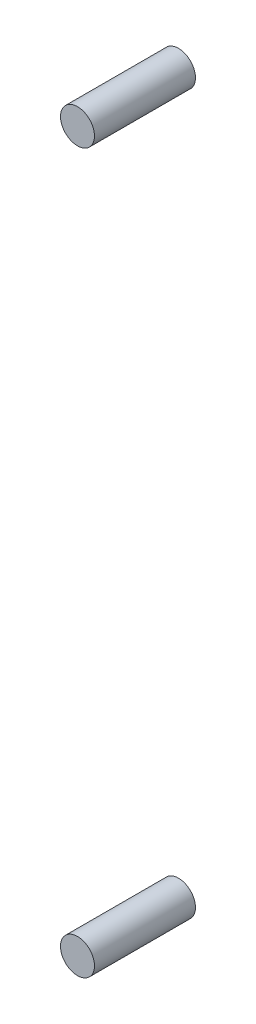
from build123d import *

# Parameters (mm, degrees)
ESQUISSE1_R          = 17.5
BOSS_EXTRU_1_DEPTH   = 104
BOSS_EXTRU_1_2_DEPTH = 104


with BuildPart() as part:
    # Esquisse1 → Boss.-Extru.1 (new body)
    with BuildSketch(Plane.XY):
        with Locations((25, 831.5)):
            Circle(ESQUISSE1_R)
    extrude(amount=-BOSS_EXTRU_1_DEPTH)


with BuildPart() as body_2:
    # Esquisse1 → Boss.-Extru.1 2 (new body)
    with BuildSketch(Plane.XY):
        with Locations((25, 91.5)):
            Circle(ESQUISSE1_R)
    extrude(amount=-BOSS_EXTRU_1_2_DEPTH)


solid = Compound([part.part, body_2.part])
